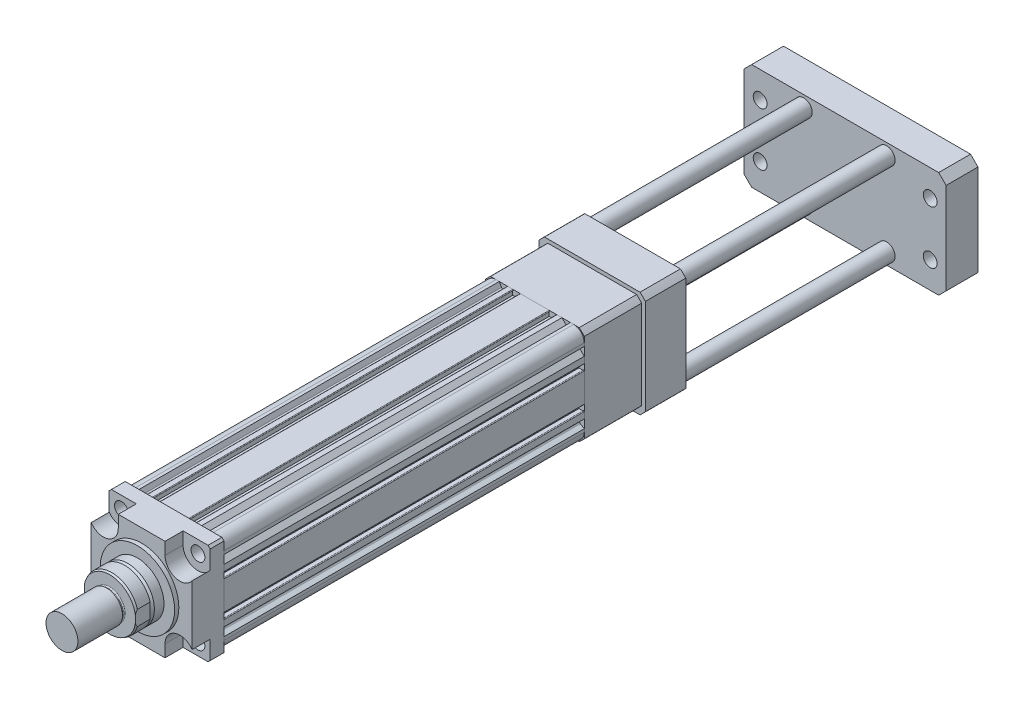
from build123d import *
from OCP.BRepFilletAPI import BRepFilletAPI_MakeChamfer

# Parameters (mm, degrees)
SKETCH_1_R          = 40
SKETCH_1_R_2        = 4.35
EXTRUDE_1_DEPTH     = 340
EXTRUDE_1_2_DEPTH   = 30
SKETCH_3_R          = 35
EXTRUDE_2_DEPTH     = 4
SKETCH_3_3_R        = 6.5
CUT_EXTRUDE_1_DEPTH = 30
SKETCH_3_4_R        = 6.5
CUT_EXTRUDE_2_DEPTH = 17
SKETCH_4_R          = 25
EXTRUDE_3_DEPTH     = 12
CHAMFER_1_SIZE      = 3
CHAMFER_1_SIZE2     = 1.732050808
EXTRUDE_4_DEPTH     = 14
CHAMFER_2_SIZE      = 2
CHAMFER_2_SIZE2     = 0.727940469
SKETCH_6_R          = 13.5
EXTRUDE_5_DEPTH     = 3
SKETCH_7_R          = 15
EXTRUDE_6_DEPTH     = 42
FILLET_1_R          = 1
EXTRUDE_7_DEPTH     = 54
EXTRUDE_8_DEPTH     = 38
SKETCH_10_R         = 40
CUT_EXTRUDE_3_DEPTH = 18.5
SKETCH_11_R         = 32
CUT_EXTRUDE_4_DEPTH = 15
SKETCH_12_R         = 40
EXTRUDE_9_DEPTH     = 1
EXTRUDE_START       = 200
SKETCH_13_W         = 190
SKETCH_13_H         = 100
SKETCH_13_R         = 6.5
EXTRUDE_10_DEPTH    = 30
SKETCH_14_R         = 8
EXTRUDE_11_DEPTH    = 200
CHAMFER_3_SIZE      = 7


with BuildPart() as part:
    # Sketch 1 → Extrude 1 (new body)
    with BuildSketch(Plane.XY):
        with BuildLine():
            Line((46.5, -36.5), (46.5, -33.5))
            Line((46.5, -33.5), (42.782554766, -31.353731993))
            ThreePointArc((42.782554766, -31.353731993), (42.192820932, -30.47113294), (42.534026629, -29.465973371))
            Line((42.534026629, -29.465973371), (46.5, -25.5))
            Line((46.5, -25.5), (46.5, -19.6))
            ThreePointArc((46.5, -19.6), (46.353553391, -19.246446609), (46, -19.1))
            ThreePointArc((46, -19.1), (45.646446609, -19.246446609), (45.5, -19.6))
            Line((45.5, -19.6), (41.5, -19.6))
            Line((41.5, -19.6), (41.5, -13.5))
            Line((41.5, -13.5), (45.5, -13.5))
            ThreePointArc((45.5, -13.5), (45.646446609, -13.853553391), (46, -14))
            ThreePointArc((46, -14), (46.353553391, -13.853553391), (46.5, -13.5))
            Line((46.5, -13.5), (46.5, 13.5))
            ThreePointArc((46.5, 13.5), (46.353553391, 13.853553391), (46, 14))
            ThreePointArc((46, 14), (45.646446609, 13.853553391), (45.5, 13.5))
            Line((45.5, 13.5), (41.5, 13.5))
            Line((41.5, 13.5), (41.5, 19.6))
            Line((41.5, 19.6), (45.5, 19.6))
            ThreePointArc((45.5, 19.6), (45.646446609, 19.246446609), (46, 19.1))
            ThreePointArc((46, 19.1), (46.353553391, 19.246446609), (46.5, 19.6))
            Line((46.5, 19.6), (46.5, 25.5))
            Line((46.5, 25.5), (42.534026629, 29.465973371))
            ThreePointArc((42.534026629, 29.465973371), (42.192820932, 30.47113294), (42.782554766, 31.353731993))
            Line((42.782554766, 31.353731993), (46.5, 33.5))
            Line((46.5, 33.5), (46.5, 36.5))
            ThreePointArc((46.5, 36.5), (43.571067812, 43.571067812), (36.5, 46.5))
            Line((36.5, 46.5), (33.5, 46.5))
            Line((33.5, 46.5), (31.353731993, 42.782554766))
            ThreePointArc((31.353731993, 42.782554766), (30.47113294, 42.192820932), (29.465973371, 42.534026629))
            Line((29.465973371, 42.534026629), (25.5, 46.5))
            Line((25.5, 46.5), (20.8, 46.5))
            ThreePointArc((20.8, 46.5), (20.446446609, 46.353553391), (20.3, 46))
            ThreePointArc((20.3, 46), (20.446446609, 45.646446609), (20.8, 45.5))
            Line((20.8, 45.5), (20.8, 41.5))
            Line((20.8, 41.5), (13.5, 41.5))
            Line((13.5, 41.5), (13.5, 45.5))
            ThreePointArc((13.5, 45.5), (13.853553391, 45.646446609), (14, 46))
            ThreePointArc((14, 46), (13.853553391, 46.353553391), (13.5, 46.5))
            Line((13.5, 46.5), (-13.5, 46.5))
            ThreePointArc((-13.5, 46.5), (-13.853553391, 46.353553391), (-14, 46))
            ThreePointArc((-14, 46), (-13.853553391, 45.646446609), (-13.5, 45.5))
            Line((-13.5, 45.5), (-13.5, 41.5))
            Line((-13.5, 41.5), (-20.8, 41.5))
            Line((-20.8, 41.5), (-20.8, 45.5))
            ThreePointArc((-20.8, 45.5), (-20.446446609, 45.646446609), (-20.3, 46))
            ThreePointArc((-20.3, 46), (-20.446446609, 46.353553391), (-20.8, 46.5))
            Line((-20.8, 46.5), (-25.5, 46.5))
            Line((-25.5, 46.5), (-29.465973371, 42.534026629))
            ThreePointArc((-29.465973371, 42.534026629), (-30.47113294, 42.192820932), (-31.353731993, 42.782554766))
            Line((-31.353731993, 42.782554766), (-33.5, 46.5))
            Line((-33.5, 46.5), (-36.5, 46.5))
            ThreePointArc((-36.5, 46.5), (-43.571067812, 43.571067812), (-46.5, 36.5))
            Line((-46.5, 36.5), (-46.5, 33.5))
            Line((-46.5, 33.5), (-42.782554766, 31.353731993))
            ThreePointArc((-42.782554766, 31.353731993), (-42.192820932, 30.47113294), (-42.534026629, 29.465973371))
            Line((-42.534026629, 29.465973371), (-46.5, 25.5))
            Line((-46.5, 25.5), (-46.5, 20))
            ThreePointArc((-46.5, 20), (-46.353553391, 19.646446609), (-46, 19.5))
            ThreePointArc((-46, 19.5), (-45.646446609, 19.646446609), (-45.5, 20))
            Line((-45.5, 20), (-41.5, 20))
            Line((-41.5, 20), (-41.5, 13.9))
            Line((-41.5, 13.9), (-45.5, 13.9))
            ThreePointArc((-45.5, 13.9), (-45.646446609, 14.253553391), (-46, 14.4))
            ThreePointArc((-46, 14.4), (-46.353553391, 14.253553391), (-46.5, 13.9))
            Line((-46.5, 13.9), (-46.5, -13.9))
            ThreePointArc((-46.5, -13.9), (-46.353553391, -14.253553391), (-46, -14.4))
            ThreePointArc((-46, -14.4), (-45.646446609, -14.253553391), (-45.5, -13.9))
            Line((-45.5, -13.9), (-41.5, -13.9))
            Line((-41.5, -13.9), (-41.5, -20))
            Line((-41.5, -20), (-45.5, -20))
            ThreePointArc((-45.5, -20), (-45.646446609, -19.646446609), (-46, -19.5))
            ThreePointArc((-46, -19.5), (-46.353553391, -19.646446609), (-46.5, -20))
            Line((-46.5, -20), (-46.5, -25.5))
            Line((-46.5, -25.5), (-42.534026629, -29.465973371))
            ThreePointArc((-42.534026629, -29.465973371), (-42.192820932, -30.47113294), (-42.782554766, -31.353731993))
            Line((-42.782554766, -31.353731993), (-46.5, -33.5))
            Line((-46.5, -33.5), (-46.5, -36.5))
            ThreePointArc((-46.5, -36.5), (-43.571067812, -43.571067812), (-36.5, -46.5))
            Line((-36.5, -46.5), (-33.5, -46.5))
            Line((-33.5, -46.5), (-31.353731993, -42.782554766))
            ThreePointArc((-31.353731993, -42.782554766), (-30.47113294, -42.192820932), (-29.465973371, -42.534026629))
            Line((-29.465973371, -42.534026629), (-25.5, -46.5))
            Line((-25.5, -46.5), (25.5, -46.5))
            Line((25.5, -46.5), (29.465973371, -42.534026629))
            ThreePointArc((29.465973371, -42.534026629), (30.47113294, -42.192820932), (31.353731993, -42.782554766))
            Line((31.353731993, -42.782554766), (33.5, -46.5))
            Line((33.5, -46.5), (36.5, -46.5))
            ThreePointArc((36.5, -46.5), (43.571067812, -43.571067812), (46.5, -36.5))
        make_face()
        Circle(SKETCH_1_R, mode=Mode.SUBTRACT)
        with Locations((36, -36)):
            Circle(SKETCH_1_R_2, mode=Mode.SUBTRACT)
        with Locations((-36, -36)):
            Circle(SKETCH_1_R_2, mode=Mode.SUBTRACT)
        with Locations((36, 36)):
            Circle(SKETCH_1_R_2, mode=Mode.SUBTRACT)
        with Locations((-36, 36)):
            Circle(SKETCH_1_R_2, mode=Mode.SUBTRACT)
        with BuildLine():
            Line((25.75, -42.5), (11.324751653, -42.5))
            ThreePointArc((11.324751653, -42.5), (10.829080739, -42.065653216), (11.194582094, -41.517241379))
            ThreePointArc((11.194582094, -41.517241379), (18.919894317, -38.613956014), (25.948275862, -34.288292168))
            ThreePointArc((25.948275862, -34.288292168), (26.472640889, -34.239297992), (26.75, -34.68699324))
            Line((26.75, -34.68699324), (26.75, -41.5))
            Line((26.75, -41.5), (25.75, -42.5))
        make_face(mode=Mode.SUBTRACT)
        with BuildLine():
            Line((-25.75, -42.5), (-11.324751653, -42.5))
            ThreePointArc((-11.324751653, -42.5), (-10.829080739, -42.065653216), (-11.194582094, -41.517241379))
            ThreePointArc((-11.194582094, -41.517241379), (-18.919894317, -38.613956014), (-25.948275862, -34.288292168))
            ThreePointArc((-25.948275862, -34.288292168), (-26.472640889, -34.239297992), (-26.75, -34.68699324))
            Line((-26.75, -34.68699324), (-26.75, -41.5))
            Line((-26.75, -41.5), (-25.75, -42.5))
        make_face(mode=Mode.SUBTRACT)
        with BuildLine():
            Line((26.312283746, 40), (20.798294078, 40))
            ThreePointArc((20.798294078, 40), (20.548294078, 39.933012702), (20.365281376, 39.75))
            Line((20.365281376, 39.75), (19.794336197, 38.761093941))
            ThreePointArc((19.794336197, 38.761093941), (19.747068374, 38.372059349), (19.994850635, 38.068437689))
            ThreePointArc((19.994850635, 38.068437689), (22.57372353, 36.598183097), (25.045011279, 34.953503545))
            ThreePointArc((25.045011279, 34.953503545), (25.441798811, 34.871210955), (25.769245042, 35.109939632))
            Line((25.769245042, 35.109939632), (27.64187192, 38.353424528))
            ThreePointArc((27.64187192, 38.353424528), (27.704581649, 38.668687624), (27.562412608, 38.956977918))
            Line((27.562412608, 38.956977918), (26.665837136, 39.853553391))
            ThreePointArc((26.665837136, 39.853553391), (26.503625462, 39.961939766), (26.312283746, 40))
        make_face(mode=Mode.SUBTRACT)
        with BuildLine():
            Line((38.956977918, 27.562412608), (39.853553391, 26.665837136))
            ThreePointArc((39.853553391, 26.665837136), (39.961939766, 26.503625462), (40, 26.312283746))
            Line((40, 26.312283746), (40, 20.798294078))
            ThreePointArc((40, 20.798294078), (39.933012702, 20.548294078), (39.75, 20.365281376))
            Line((39.75, 20.365281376), (38.761093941, 19.794336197))
            ThreePointArc((38.761093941, 19.794336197), (38.372059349, 19.747068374), (38.068437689, 19.994850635))
            ThreePointArc((38.068437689, 19.994850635), (36.598183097, 22.57372353), (34.953503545, 25.045011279))
            ThreePointArc((34.953503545, 25.045011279), (34.871210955, 25.441798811), (35.109939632, 25.769245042))
            Line((35.109939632, 25.769245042), (38.353424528, 27.64187192))
            ThreePointArc((38.353424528, 27.64187192), (38.668687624, 27.704581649), (38.956977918, 27.562412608))
        make_face(mode=Mode.SUBTRACT)
        with BuildLine():
            Line((38.956977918, -27.562412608), (39.853553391, -26.665837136))
            ThreePointArc((39.853553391, -26.665837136), (39.961939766, -26.503625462), (40, -26.312283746))
            Line((40, -26.312283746), (40, -20.798294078))
            ThreePointArc((40, -20.798294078), (39.933012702, -20.548294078), (39.75, -20.365281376))
            Line((39.75, -20.365281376), (38.761093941, -19.794336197))
            ThreePointArc((38.761093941, -19.794336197), (38.372059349, -19.747068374), (38.068437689, -19.994850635))
            ThreePointArc((38.068437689, -19.994850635), (36.598183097, -22.57372353), (34.953503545, -25.045011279))
            ThreePointArc((34.953503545, -25.045011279), (34.871210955, -25.441798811), (35.109939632, -25.769245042))
            Line((35.109939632, -25.769245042), (38.353424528, -27.64187192))
            ThreePointArc((38.353424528, -27.64187192), (38.668687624, -27.704581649), (38.956977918, -27.562412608))
        make_face(mode=Mode.SUBTRACT)
        with BuildLine():
            Line((-39.75, -20.365281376), (-38.761093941, -19.794336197))
            ThreePointArc((-38.761093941, -19.794336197), (-38.372059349, -19.747068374), (-38.068437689, -19.994850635))
            ThreePointArc((-38.068437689, -19.994850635), (-36.598183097, -22.57372353), (-34.953503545, -25.045011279))
            ThreePointArc((-34.953503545, -25.045011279), (-34.871210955, -25.441798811), (-35.109939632, -25.769245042))
            Line((-35.109939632, -25.769245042), (-38.353424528, -27.64187192))
            ThreePointArc((-38.353424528, -27.64187192), (-38.668687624, -27.704581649), (-38.956977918, -27.562412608))
            Line((-38.956977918, -27.562412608), (-39.853553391, -26.665837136))
            ThreePointArc((-39.853553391, -26.665837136), (-39.961939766, -26.503625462), (-40, -26.312283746))
            Line((-40, -26.312283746), (-40, -20.798294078))
            ThreePointArc((-40, -20.798294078), (-39.933012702, -20.548294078), (-39.75, -20.365281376))
        make_face(mode=Mode.SUBTRACT)
        with BuildLine():
            Line((-20.365281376, 39.75), (-19.794336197, 38.761093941))
            ThreePointArc((-19.794336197, 38.761093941), (-19.747068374, 38.372059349), (-19.994850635, 38.068437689))
            ThreePointArc((-19.994850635, 38.068437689), (-22.57372353, 36.598183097), (-25.045011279, 34.953503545))
            ThreePointArc((-25.045011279, 34.953503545), (-25.441798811, 34.871210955), (-25.769245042, 35.109939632))
            Line((-25.769245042, 35.109939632), (-27.64187192, 38.353424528))
            ThreePointArc((-27.64187192, 38.353424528), (-27.704581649, 38.668687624), (-27.562412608, 38.956977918))
            Line((-27.562412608, 38.956977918), (-26.665837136, 39.853553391))
            ThreePointArc((-26.665837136, 39.853553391), (-26.503625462, 39.961939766), (-26.312283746, 40))
            Line((-26.312283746, 40), (-20.798294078, 40))
            ThreePointArc((-20.798294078, 40), (-20.548294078, 39.933012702), (-20.365281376, 39.75))
        make_face(mode=Mode.SUBTRACT)
        with BuildLine():
            Line((-38.956977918, 27.562412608), (-39.853553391, 26.665837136))
            ThreePointArc((-39.853553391, 26.665837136), (-39.961939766, 26.503625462), (-40, 26.312283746))
            Line((-40, 26.312283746), (-40, 20.798294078))
            ThreePointArc((-40, 20.798294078), (-39.933012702, 20.548294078), (-39.75, 20.365281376))
            Line((-39.75, 20.365281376), (-38.761093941, 19.794336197))
            ThreePointArc((-38.761093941, 19.794336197), (-38.372059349, 19.747068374), (-38.068437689, 19.994850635))
            ThreePointArc((-38.068437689, 19.994850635), (-36.598183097, 22.57372353), (-34.953503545, 25.045011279))
            ThreePointArc((-34.953503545, 25.045011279), (-34.871210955, 25.441798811), (-35.109939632, 25.769245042))
            Line((-35.109939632, 25.769245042), (-38.353424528, 27.64187192))
            ThreePointArc((-38.353424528, 27.64187192), (-38.668687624, 27.704581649), (-38.956977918, 27.562412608))
        make_face(mode=Mode.SUBTRACT)
    extrude(amount=EXTRUDE_1_DEPTH)

    # Sketch 2 → Extrude 1 2 (add)
    with BuildSketch(Plane.XY.offset(340)):
        Polygon((-47.5, 45.5), (-45.5, 47.5), (45.5, 47.5), (47.5, 45.5), (47.5, -45.5), (45.5, -47.5), (-45.5, -47.5), (-47.5, -45.5), align=None)
    extrude(amount=EXTRUDE_1_2_DEPTH)

    # Sketch 3 → Extrude 2 (add)
    with BuildSketch(Plane.XY.offset(370)):
        Circle(SKETCH_3_R)
    extrude(amount=EXTRUDE_2_DEPTH)

    # Sketch 3_3 → Cut-Extrude 1 (cut)
    with BuildSketch(Plane.XY.offset(370)):
        with Locations((-36, 36)):
            Circle(SKETCH_3_3_R)
        with Locations((36, 36)):
            Circle(SKETCH_3_3_R)
        with Locations((60, 32.5)):
            Circle(SKETCH_3_3_R)
        with Locations((36, -36)):
            Circle(SKETCH_3_3_R)
        with Locations((-36, -36)):
            Circle(SKETCH_3_3_R)
        with Locations((-60, -32.5)):
            Circle(SKETCH_3_3_R)
        with Locations((-60, 32.5)):
            Circle(SKETCH_3_3_R)
    extrude(amount=-CUT_EXTRUDE_1_DEPTH, mode=Mode.SUBTRACT)

    # Sketch 3_4 → Cut-Extrude 2 (cut)
    # profile 1 of 4: a face of its own
    with BuildSketch(Plane.XY.offset(370)):
        with BuildLine():
            Line((-47.5, 45.5), (-47.5, 28.015640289))
            ThreePointArc((-47.5, 28.015640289), (-31.816699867, 22.639610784), (-22, 36))
            Line((-22, 36), (-22, 47.5))
            Line((-22, 47.5), (-45.5, 47.5))
            Line((-45.5, 47.5), (-47.5, 45.5))
        make_face()
        with Locations((-36, 36)):
            Circle(SKETCH_3_4_R, mode=Mode.SUBTRACT)
    # profile 2 of 4: a face of its own
    with BuildSketch(Plane.XY.offset(370)):
        with BuildLine():
            ThreePointArc((-22, -36), (-31.816699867, -22.639610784), (-47.5, -28.015640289))
            Line((-47.5, -28.015640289), (-47.5, -45.5))
            Line((-47.5, -45.5), (-45.5, -47.5))
            Line((-45.5, -47.5), (-22, -47.5))
            Line((-22, -47.5), (-22, -36))
        make_face()
        with Locations((-36, -36)):
            Circle(SKETCH_3_4_R, mode=Mode.SUBTRACT)
    # profile 3 of 4: a face of its own
    with BuildSketch(Plane.XY.offset(370)):
        with BuildLine():
            Line((45.5, 47.5), (22, 47.5))
            Line((22, 47.5), (22, 36))
            ThreePointArc((22, 36), (31.816699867, 22.639610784), (47.5, 28.015640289))
            Line((47.5, 28.015640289), (47.5, 45.5))
            Line((47.5, 45.5), (45.5, 47.5))
        make_face()
        with Locations((36, 36)):
            Circle(SKETCH_3_4_R, mode=Mode.SUBTRACT)
    # profile 4 of 4: a face of its own
    with BuildSketch(Plane.XY.offset(370)):
        with BuildLine():
            Line((22, -36), (22, -47.5))
            Line((22, -47.5), (45.5, -47.5))
            Line((45.5, -47.5), (47.5, -45.5))
            Line((47.5, -45.5), (47.5, -28.015640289))
            ThreePointArc((47.5, -28.015640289), (31.816699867, -22.639610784), (22, -36))
        make_face()
        with Locations((36, -36)):
            Circle(SKETCH_3_4_R, mode=Mode.SUBTRACT)
    extrude(amount=-CUT_EXTRUDE_2_DEPTH, mode=Mode.SUBTRACT)

    # Sketch 4 → Extrude 3 (add)
    with BuildSketch(Plane.XY.offset(374)):
        Circle(SKETCH_4_R)
    extrude(amount=EXTRUDE_3_DEPTH)

    # Chamfer 1
    chamfer_1_edges = [part.edges().sort_by_distance(p)[0] for p in [
        (-25, 0, 386),
    ]]
    chamfer_1_side = [part.faces().sort_by_distance(p)[0] for p in [
        (-25, 0, 380),
    ]]
    chamfer(chamfer_1_edges, length=CHAMFER_1_SIZE, length2=CHAMFER_1_SIZE2, reference=chamfer_1_side[0])

    # Sketch 5 → Extrude 4 (add)
    with BuildSketch(Plane.XY.offset(386)):
        with BuildLine():
            Line((-24, 7), (-24, -7))
            ThreePointArc((-24, -7), (0, -25), (24, -7))
            Line((24, -7), (24, 7))
            ThreePointArc((24, 7), (0, 25), (-24, 7))
        make_face()
    extrude(amount=EXTRUDE_4_DEPTH)

    # Chamfer 2: one chamfer whose edges measure the first distance from different faces: ONE call of the kernel's chamfer builder (chamfer() names one face for all edges)
    chamfer_2_edges_1 = [part.edges().sort_by_distance(p)[0] for p in [
        (0, 25, 400),
    ]]
    chamfer_2_side_1 = [part.faces().sort_by_distance(p)[0] for p in [
        (0, 25, 393),
    ]]
    chamfer_2_edges_2 = [part.edges().sort_by_distance(p)[0] for p in [
        (0, -25, 400),
    ]]
    chamfer_2_side_2 = [part.faces().sort_by_distance(p)[0] for p in [
        (0, -25, 393),
    ]]
    chamfer_2 = BRepFilletAPI_MakeChamfer(part.part.solid().wrapped)
    for e in chamfer_2_edges_1:
        chamfer_2.Add(CHAMFER_2_SIZE, CHAMFER_2_SIZE2, e.wrapped, chamfer_2_side_1[0].wrapped)  # the first distance lies on this face
    for e in chamfer_2_edges_2:
        chamfer_2.Add(CHAMFER_2_SIZE, CHAMFER_2_SIZE2, e.wrapped, chamfer_2_side_2[0].wrapped)  # the first distance lies on this face
    add(Compound.cast(chamfer_2.Shape()), mode=Mode.REPLACE)

    # Sketch 6 → Extrude 5 (add)
    with BuildSketch(Plane.XY.offset(400)):
        Circle(SKETCH_6_R)
    extrude(amount=EXTRUDE_5_DEPTH)

    # Sketch 7 → Extrude 6 (add)
    with BuildSketch(Plane.XY.offset(403)):
        with Locations(Location((0, 0, 0), (0, 0, 180))):
            Circle(SKETCH_7_R)
    extrude(amount=EXTRUDE_6_DEPTH)

    # Fillet 1
    fillet_1_edges = [part.edges().sort_by_distance(p)[0] for p in [
        (-13.5, 0, 400),
    ]]
    fillet(fillet_1_edges, radius=FILLET_1_R)


with BuildPart() as body_2:
    # Sketch 8 → Extrude 7 (new body)
    with BuildSketch(Plane(origin=(0, 0, 0), x_dir=(-1, 0, 0), z_dir=(0, 0, -1))):
        with BuildLine():
            Line((-41.761226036, 46.5), (41.761226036, 46.5))
            ThreePointArc((41.761226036, 46.5), (44.194173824, 44.194173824), (46.5, 41.761226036))
            Line((46.5, 41.761226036), (46.5, -41.761226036))
            ThreePointArc((46.5, -41.761226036), (44.194173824, -44.194173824), (41.761226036, -46.5))
            Line((41.761226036, -46.5), (-41.761226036, -46.5))
            ThreePointArc((-41.761226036, -46.5), (-44.194173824, -44.194173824), (-46.5, -41.761226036))
            Line((-46.5, -41.761226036), (-46.5, 41.761226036))
            ThreePointArc((-46.5, 41.761226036), (-44.194173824, 44.194173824), (-41.761226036, 46.5))
        make_face()
    extrude(amount=EXTRUDE_7_DEPTH)

    # Sketch 9 → Extrude 8 (add)
    with BuildSketch(Plane(origin=(0, 0, -54), x_dir=(-1, 0, 0), z_dir=(0, 0, -1))):
        with BuildLine():
            Line((-44.972908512, 50), (44.972908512, 50))
            ThreePointArc((44.972908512, 50), (47.552931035, 47.552931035), (50, 44.972908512))
            Line((50, 44.972908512), (50, -44.972908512))
            ThreePointArc((50, -44.972908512), (47.552931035, -47.552931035), (44.972908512, -50))
            Line((44.972908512, -50), (-44.972908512, -50))
            ThreePointArc((-44.972908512, -50), (-47.552931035, -47.552931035), (-50, -44.972908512))
            Line((-50, -44.972908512), (-50, 44.972908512))
            ThreePointArc((-50, 44.972908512), (-47.552931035, 47.552931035), (-44.972908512, 50))
        make_face()
    extrude(amount=EXTRUDE_8_DEPTH)

    # Sketch 10 → Cut-Extrude 3 (cut)
    with BuildSketch(Plane(origin=(0, 0, -92), x_dir=(-1, 0, 0), z_dir=(0, 0, -1))):
        Circle(SKETCH_10_R)
    extrude(amount=-CUT_EXTRUDE_3_DEPTH, mode=Mode.SUBTRACT)

    # Sketch 11 → Cut-Extrude 4 (cut)
    with BuildSketch(Plane(origin=(0, 0, -73.5), x_dir=(-1, 0, 0), z_dir=(0, 0, -1))):
        Circle(SKETCH_11_R)
    extrude(amount=-CUT_EXTRUDE_4_DEPTH, mode=Mode.SUBTRACT)

    # Sketch 12 → Extrude 9 (add)
    with BuildSketch(Plane(origin=(0, 0, -92), x_dir=(-1, 0, 0), z_dir=(0, 0, -1))):
        Circle(SKETCH_12_R)
    extrude(amount=-EXTRUDE_9_DEPTH)

    # Sketch 14 → Extrude 11 (add)
    with BuildSketch(Plane(origin=(0, 0, -92), x_dir=(-1, 0, 0), z_dir=(0, 0, -1))):
        with Locations((39, 39.374289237)):
            Circle(SKETCH_14_R)
        with Locations((39, -39)):
            Circle(SKETCH_14_R)
        with Locations(Location((-39, -39, 0), (0, 0, 180))):
            Circle(SKETCH_14_R)
        with Locations(Location((-39, 39.374289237, 0), (0, 0, 180))):
            Circle(SKETCH_14_R)
    extrude(amount=EXTRUDE_11_DEPTH)


with BuildPart() as body_3:
    # Sketch 13 → Extrude 10 (new body)
    with BuildSketch(Plane(origin=(0, 0, -92), x_dir=(-1, 0, 0), z_dir=(0, 0, -1)).offset(EXTRUDE_START)):
        Rectangle(SKETCH_13_W, SKETCH_13_H)
        with Locations((-80, 25)):
            Circle(SKETCH_13_R, mode=Mode.SUBTRACT)
        with Locations((-80, -25)):
            Circle(SKETCH_13_R, mode=Mode.SUBTRACT)
        with Locations(Location((80, -25, 0), (0, 0, 180))):
            Circle(SKETCH_13_R, mode=Mode.SUBTRACT)
        with Locations(Location((80, 25, 0), (0, 0, 180))):
            Circle(SKETCH_13_R, mode=Mode.SUBTRACT)
    extrude(amount=EXTRUDE_10_DEPTH)

    # Chamfer 3
    chamfer_3_edges = [body_3.edges().sort_by_distance(p)[0] for p in [
        (95, 50, -307),
        (-95, 50, -307),
        (-95, -50, -307),
        (95, -50, -307),
    ]]
    chamfer(chamfer_3_edges, length=CHAMFER_3_SIZE)


solid = Compound([part.part, body_2.part, body_3.part])
